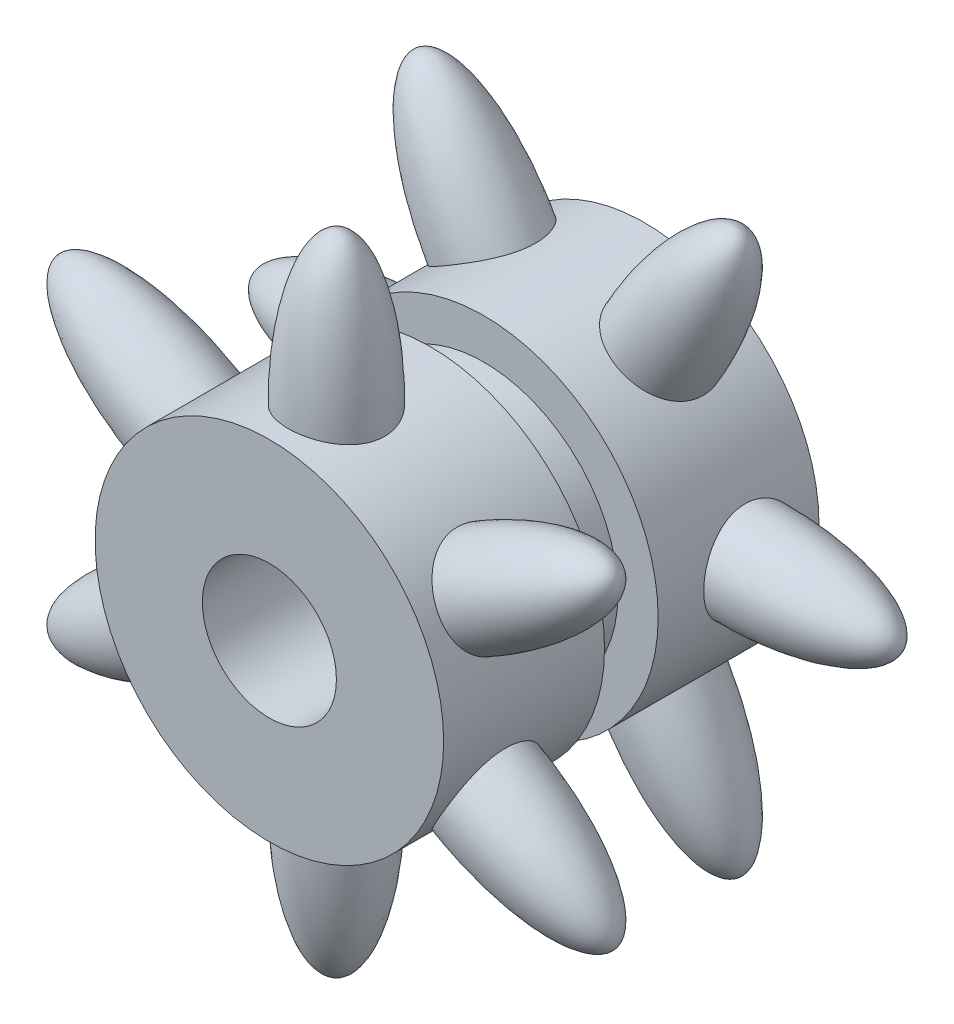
from build123d import *

# Parameters (mm, degrees)
SKETCH_1_R               = 3.25
SKETCH_1_R_2             = 1.25
EXTRUDE_1_DEPTH          = 3.5
SKETCH_2_R               = 3.25
SKETCH_2_R_2             = 2.5
CUT_EXTRUDE_1_DEPTH      = 0.5
PATTERN_CIRCULAR_4_COUNT = 6
SKETCH_6_R               = 1.25
CUT_EXTRUDE_3_DEPTH      = 12.000000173


with BuildPart() as part:
    # Sketch 1 → Extrude 1 (new, symmetric)
    with BuildSketch(Plane.XY):
        Circle(SKETCH_1_R)
        Circle(SKETCH_1_R_2, mode=Mode.SUBTRACT)
    extrude(amount=EXTRUDE_1_DEPTH, both=True)

    # Sketch 2 → Cut-Extrude 1 (cut, symmetric)
    with BuildSketch(Plane.XY):
        Circle(SKETCH_2_R)
        Circle(SKETCH_2_R_2, mode=Mode.SUBTRACT)
    extrude(amount=CUT_EXTRUDE_1_DEPTH, both=True, mode=Mode.SUBTRACT)

    # Sketch 3 → Revolve 1 (revolve)
    with BuildSketch(Plane.XY.offset(2.25)):
        with BuildLine():
            Line((0, 6), (0, 0.5))
            add(Edge.make_bspline(
                [(0, 6), (-0.9, 6), (-0.9, 3.25), (-0.9, 0.5), (0, 0.5)],
                knots=[0, 0, 0, 1.570796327, 1.570796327, 3.141592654, 3.141592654, 3.141592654], degree=2, weights=[1, 0.707106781, 1, 0.707106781, 1]))
        make_face()
    revolve_1 = revolve(axis=Axis((0, 6, 2.25), (0, -1, 0)))

    # Sketch 4 → Revolve 2 (revolve)
    with BuildSketch(Plane(origin=(0, 0, -2.25), x_dir=(-1, 0, 0), z_dir=(0, 0, -1))):
        with BuildLine():
            Line((-3, 5.196152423), (-0.25, 0.433012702))
            add(Edge.make_bspline(
                [(-3, 5.196152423), (-3.779422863, 4.746152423), (-2.404422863, 2.364582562), (-1.029422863, -0.016987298), (-0.25, 0.433012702)],
                knots=[0, 0, 0, 1.570796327, 1.570796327, 3.141592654, 3.141592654, 3.141592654], degree=2, weights=[1, 0.707106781, 1, 0.707106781, 1]))
        make_face()
    revolve_2 = revolve(axis=Axis((3, 5.196152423, -2.25), (-0.5000000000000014, -0.8660254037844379, 0)))

    # Pattern Circular 4: Revolve 1, Revolve 2 ×6 about axis
    pattern_circular_4_axis = Axis((0, 0, 3.5), (0, 0, 1))
    add([revolve_1.rotate(pattern_circular_4_axis, i * 360 / PATTERN_CIRCULAR_4_COUNT) for i in range(1, PATTERN_CIRCULAR_4_COUNT)])
    add([revolve_2.rotate(pattern_circular_4_axis, i * 360 / PATTERN_CIRCULAR_4_COUNT) for i in range(1, PATTERN_CIRCULAR_4_COUNT)])

    # Sketch 6 → Cut-Extrude 3 (cut, through all)
    with BuildSketch(Plane(origin=(0, 0, -3.5), x_dir=(-1, 0, 0), z_dir=(0, 0, -1))):
        with Locations(Location((0, 0, 0), (0, 0, 180))):
            Circle(SKETCH_6_R)
    extrude(amount=-CUT_EXTRUDE_3_DEPTH, mode=Mode.SUBTRACT)


solid = part.part
